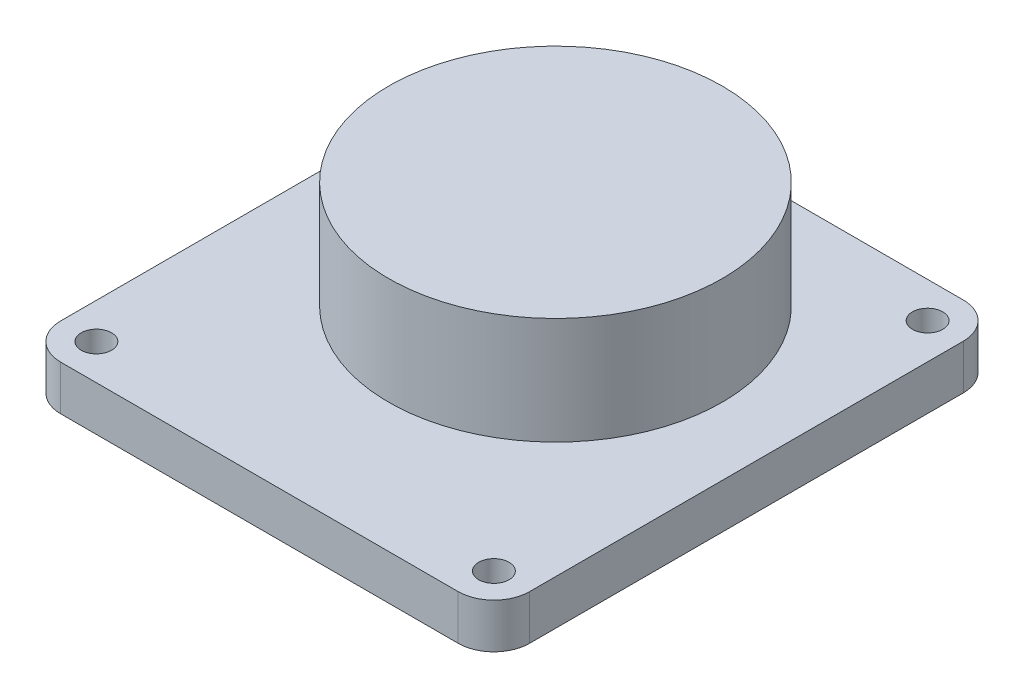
from build123d import *

# Parameters (mm, degrees)
SKETCH1_R           = 1.0795
BOSS_EXTRUDE1_DEPTH = 3.1877
SKETCH2_R           = 11.86815
BOSS_EXTRUDE2_DEPTH = 7.62


with BuildPart() as part:
    # Sketch1 → Boss-Extrude1 (new body)
    with BuildSketch(Plane(origin=(0, 0, 0), x_dir=(1, 0, 0), z_dir=(0, 1, 0))):
        with BuildLine():
            Line((2.54, -2.54), (30.8229, -2.54))
            ThreePointArc((30.8229, -2.54), (32.618951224, -1.796051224), (33.3629, 0))
            Line((33.3629, 0), (33.3629, 30.861))
            ThreePointArc((33.3629, 30.861), (32.618951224, 32.657051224), (30.8229, 33.401))
            Line((30.8229, 33.401), (2.54, 33.401))
            ThreePointArc((2.54, 33.401), (0.743948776, 32.657051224), (0, 30.861))
            Line((0, 30.861), (0, 0))
            ThreePointArc((0, 0), (0.743948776, -1.796051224), (2.54, -2.54))
        make_face()
        with Locations(Location((2.54, 30.861, 0), (0, 0, 270))):
            Circle(SKETCH1_R, mode=Mode.SUBTRACT)
        with Locations(Location((30.8229, 30.861, 0), (0, 0, 270))):
            Circle(SKETCH1_R, mode=Mode.SUBTRACT)
        with Locations(Location((30.8229, 0, 0), (0, 0, 270))):
            Circle(SKETCH1_R, mode=Mode.SUBTRACT)
        with Locations(Location((2.54, 0, 0), (0, 0, 270))):
            Circle(SKETCH1_R, mode=Mode.SUBTRACT)
    extrude(amount=BOSS_EXTRUDE1_DEPTH)

    # Sketch2 → Boss-Extrude2 (add)
    with BuildSketch(Plane(origin=(0, 3.1877, 0), x_dir=(1, 0, 0), z_dir=(0, 1, 0))):
        with Locations(Location((16.68145, 18.52295, 0), (0, 0, 90))):
            Circle(SKETCH2_R)
    extrude(amount=BOSS_EXTRUDE2_DEPTH)


solid = part.part
